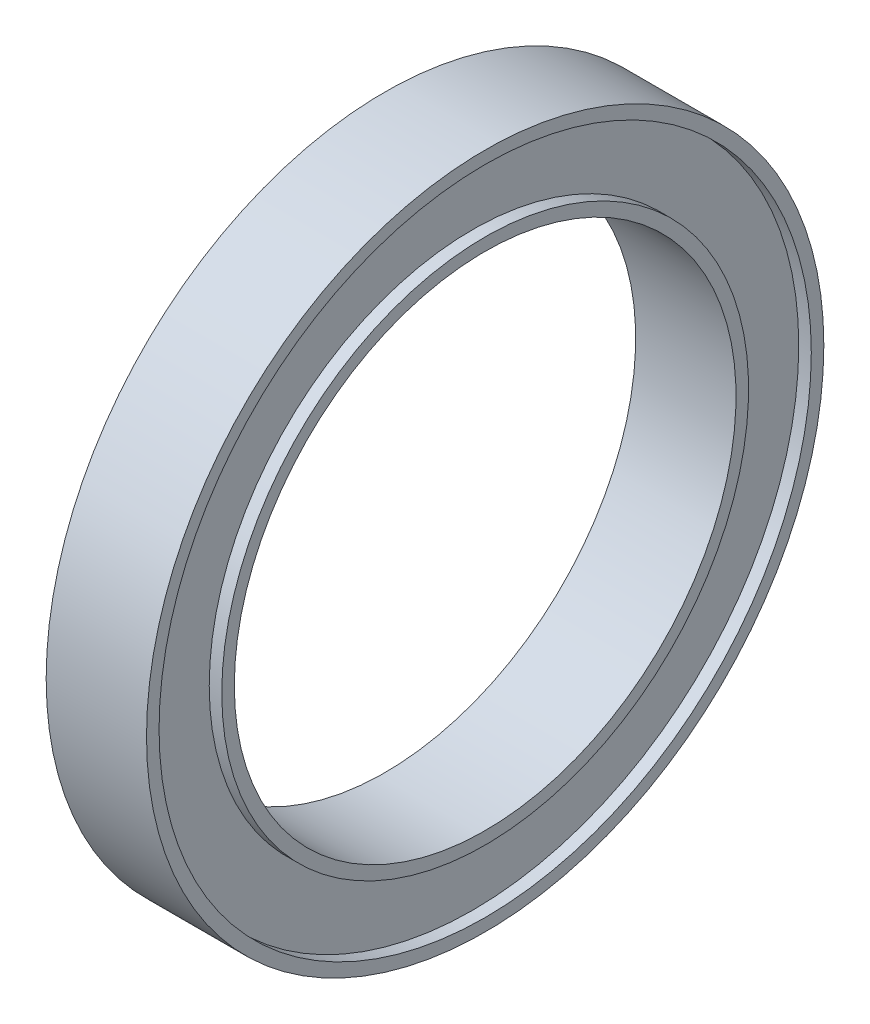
from build123d import *

# Parameters (mm, degrees)
SKETCH1_R           = 13.5
BOSS_EXTRUDE1_DEPTH = 2
SKETCH2_R           = 10
CUT_EXTRUDE1_DEPTH  = 4
SKETCH3_R           = 13
SKETCH3_R_2         = 10.5
CUT_EXTRUDE2_DEPTH  = 0.5


with BuildPart() as part:
    # Sketch1 → Boss-Extrude1 (new, symmetric)
    with BuildSketch(Plane(origin=(0, 0, 0), x_dir=(0, 0, -1), z_dir=(1, 0, 0))):
        Circle(SKETCH1_R)
    extrude(amount=BOSS_EXTRUDE1_DEPTH, both=True)

    # Sketch2 → Cut-Extrude1 (cut)
    with BuildSketch(Plane.ZY.offset(2)):
        Circle(SKETCH2_R)
    extrude(amount=-CUT_EXTRUDE1_DEPTH, mode=Mode.SUBTRACT)

    # Sketch3 → Cut-Extrude2 (cut)
    with BuildSketch(Plane.ZY.offset(2)):
        Circle(SKETCH3_R)
        Circle(SKETCH3_R_2, mode=Mode.SUBTRACT)
    cut_extrude2 = extrude(amount=-CUT_EXTRUDE2_DEPTH, mode=Mode.SUBTRACT)

    # Mirror1: Cut-Extrude2 across plane
    add(cut_extrude2.mirror(Plane(origin=(0, 0, 0), x_dir=(0, 0, 1), z_dir=(1, 0, 0))), mode=Mode.SUBTRACT)


solid = part.part
